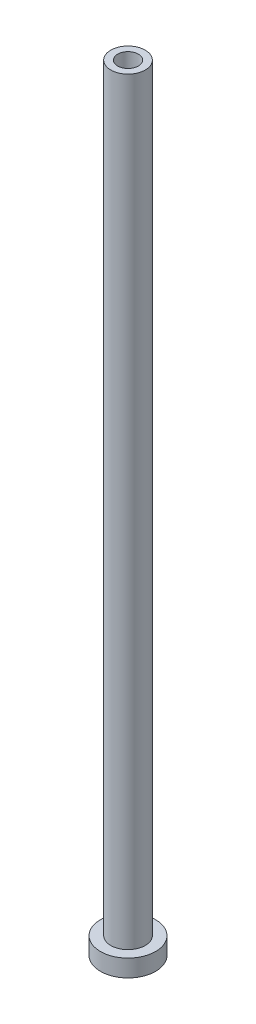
ISO-10303-21;
HEADER;
FILE_DESCRIPTION(('STEP AP214'),'2;1');
FILE_NAME('part.step','',(''),(''),'','','');
FILE_SCHEMA(('AUTOMOTIVE_DESIGN { 1 0 10303 214 1 1 1 1 }'));
ENDSEC;
DATA;
#1=APPLICATION_CONTEXT('core data for automotive mechanical design processes');
#2=APPLICATION_PROTOCOL_DEFINITION('international standard','automotive_design',2000,#1);
#3=PRODUCT_CONTEXT('',#1,'mechanical');
#4=PRODUCT('Part','Part','',(#3));
#5=PRODUCT_RELATED_PRODUCT_CATEGORY('part','',(#4));
#6=PRODUCT_DEFINITION_FORMATION('','',#4);
#7=PRODUCT_DEFINITION_CONTEXT('part definition',#1,'design');
#8=PRODUCT_DEFINITION('design','',#6,#7);
#9=PRODUCT_DEFINITION_SHAPE('','',#8);
#10=(LENGTH_UNIT() NAMED_UNIT(*) SI_UNIT(.MILLI.,.METRE.));
#11=(NAMED_UNIT(*) PLANE_ANGLE_UNIT() SI_UNIT($,.RADIAN.));
#12=(NAMED_UNIT(*) SI_UNIT($,.STERADIAN.) SOLID_ANGLE_UNIT());
#13=UNCERTAINTY_MEASURE_WITH_UNIT(LENGTH_MEASURE(1.E-05),#10,'distance_accuracy_value','');
#14=(GEOMETRIC_REPRESENTATION_CONTEXT(3) GLOBAL_UNCERTAINTY_ASSIGNED_CONTEXT((#13)) GLOBAL_UNIT_ASSIGNED_CONTEXT((#10,
#11,#12)) REPRESENTATION_CONTEXT('',''));
#15=CARTESIAN_POINT('',(0.,0.,0.));
#16=DIRECTION('',(0.,0.,1.));
#17=DIRECTION('',(1.,0.,0.));
#18=AXIS2_PLACEMENT_3D('',#15,#16,#17);
#19=CARTESIAN_POINT('',(0.,0.,0.));
#20=DIRECTION('',(0.,-1.,0.));
#21=DIRECTION('',(0.,0.,-1.));
#22=AXIS2_PLACEMENT_3D('',#19,#20,#21);
#23=CYLINDRICAL_SURFACE('',#22,8.);
#24=CARTESIAN_POINT('',(0.,-5.,0.));
#25=DIRECTION('',(0.,-1.,0.));
#26=DIRECTION('',(0.,0.,-1.));
#27=AXIS2_PLACEMENT_3D('',#24,#25,#26);
#28=CIRCLE('',#27,8.);
#29=CARTESIAN_POINT('',(0.,-5.,-8.));
#30=VERTEX_POINT('',#29);
#31=EDGE_CURVE('E42',#30,#30,#28,.T.);
#32=ORIENTED_EDGE('',*,*,#31,.F.);
#33=EDGE_LOOP('',(#32));
#34=FACE_BOUND('',#33,.T.);
#35=CARTESIAN_POINT('',(0.,0.,0.));
#36=DIRECTION('',(0.,-1.,0.));
#37=DIRECTION('',(0.,0.,-1.));
#38=AXIS2_PLACEMENT_3D('',#35,#36,#37);
#39=CIRCLE('',#38,8.);
#40=CARTESIAN_POINT('',(0.,0.,-8.));
#41=VERTEX_POINT('',#40);
#42=EDGE_CURVE('E9',#41,#41,#39,.T.);
#43=ORIENTED_EDGE('',*,*,#42,.T.);
#44=EDGE_LOOP('',(#43));
#45=FACE_BOUND('',#44,.T.);
#46=ADVANCED_FACE('F14',(#34,#45),#23,.T.);
#47=CARTESIAN_POINT('',(-8.,0.,0.));
#48=DIRECTION('',(0.,-1.,0.));
#49=DIRECTION('',(0.,0.,-1.));
#50=AXIS2_PLACEMENT_3D('',#47,#48,#49);
#51=PLANE('',#50);
#52=ORIENTED_EDGE('',*,*,#42,.F.);
#53=EDGE_LOOP('',(#52));
#54=FACE_BOUND('',#53,.T.);
#55=CARTESIAN_POINT('',(0.,0.,0.));
#56=DIRECTION('',(0.,-1.,0.));
#57=DIRECTION('',(0.,0.,-1.));
#58=AXIS2_PLACEMENT_3D('',#55,#56,#57);
#59=CIRCLE('',#58,5.);
#60=CARTESIAN_POINT('',(0.,0.,-5.));
#61=VERTEX_POINT('',#60);
#62=EDGE_CURVE('E20',#61,#61,#59,.T.);
#63=ORIENTED_EDGE('',*,*,#62,.T.);
#64=EDGE_LOOP('',(#63));
#65=FACE_BOUND('',#64,.T.);
#66=ADVANCED_FACE('F49',(#54,#65),#51,.F.);
#67=CARTESIAN_POINT('',(0.,0.,0.));
#68=DIRECTION('',(0.,-1.,0.));
#69=DIRECTION('',(0.,0.,-1.));
#70=AXIS2_PLACEMENT_3D('',#67,#68,#69);
#71=CYLINDRICAL_SURFACE('',#70,5.);
#72=ORIENTED_EDGE('',*,*,#62,.F.);
#73=EDGE_LOOP('',(#72));
#74=FACE_BOUND('',#73,.T.);
#75=CARTESIAN_POINT('',(0.,220.,0.));
#76=DIRECTION('',(0.,-1.,0.));
#77=DIRECTION('',(0.,0.,-1.));
#78=AXIS2_PLACEMENT_3D('',#75,#76,#77);
#79=CIRCLE('',#78,5.);
#80=CARTESIAN_POINT('',(0.,220.,-5.));
#81=VERTEX_POINT('',#80);
#82=EDGE_CURVE('E24',#81,#81,#79,.T.);
#83=ORIENTED_EDGE('',*,*,#82,.T.);
#84=EDGE_LOOP('',(#83));
#85=FACE_BOUND('',#84,.T.);
#86=ADVANCED_FACE('F55',(#74,#85),#71,.T.);
#87=CARTESIAN_POINT('',(-5.,220.,0.));
#88=DIRECTION('',(0.,-1.,0.));
#89=DIRECTION('',(0.,0.,-1.));
#90=AXIS2_PLACEMENT_3D('',#87,#88,#89);
#91=PLANE('',#90);
#92=ORIENTED_EDGE('',*,*,#82,.F.);
#93=EDGE_LOOP('',(#92));
#94=FACE_BOUND('',#93,.T.);
#95=CARTESIAN_POINT('',(0.,220.,0.));
#96=DIRECTION('',(0.,-1.,0.));
#97=DIRECTION('',(0.,0.,-1.));
#98=AXIS2_PLACEMENT_3D('',#95,#96,#97);
#99=CIRCLE('',#98,3.);
#100=CARTESIAN_POINT('',(0.,220.,-3.));
#101=VERTEX_POINT('',#100);
#102=EDGE_CURVE('E28',#101,#101,#99,.T.);
#103=ORIENTED_EDGE('',*,*,#102,.T.);
#104=EDGE_LOOP('',(#103));
#105=FACE_BOUND('',#104,.T.);
#106=ADVANCED_FACE('F61',(#94,#105),#91,.F.);
#107=CARTESIAN_POINT('',(0.,0.,0.));
#108=DIRECTION('',(0.,-1.,0.));
#109=DIRECTION('',(0.,0.,-1.));
#110=AXIS2_PLACEMENT_3D('',#107,#108,#109);
#111=CYLINDRICAL_SURFACE('',#110,3.);
#112=ORIENTED_EDGE('',*,*,#102,.F.);
#113=EDGE_LOOP('',(#112));
#114=FACE_BOUND('',#113,.T.);
#115=CARTESIAN_POINT('',(0.,175.,0.));
#116=DIRECTION('',(0.,-1.,0.));
#117=DIRECTION('',(0.,0.,-1.));
#118=AXIS2_PLACEMENT_3D('',#115,#116,#117);
#119=CIRCLE('',#118,3.);
#120=CARTESIAN_POINT('',(0.,175.,-3.));
#121=VERTEX_POINT('',#120);
#122=EDGE_CURVE('E33',#121,#121,#119,.T.);
#123=ORIENTED_EDGE('',*,*,#122,.T.);
#124=EDGE_LOOP('',(#123));
#125=FACE_BOUND('',#124,.T.);
#126=ADVANCED_FACE('F67',(#114,#125),#111,.F.);
#127=CARTESIAN_POINT('',(0.,174.75,0.));
#128=DIRECTION('',(0.,-1.,0.));
#129=DIRECTION('',(0.,0.,-1.));
#130=AXIS2_PLACEMENT_3D('',#127,#128,#129);
#131=CONICAL_SURFACE('',#130,3.25,0.785398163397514);
#132=ORIENTED_EDGE('',*,*,#122,.F.);
#133=EDGE_LOOP('',(#132));
#134=FACE_BOUND('',#133,.T.);
#135=CARTESIAN_POINT('',(0.,174.75,0.));
#136=DIRECTION('',(0.,-1.,0.));
#137=DIRECTION('',(0.,0.,-1.));
#138=AXIS2_PLACEMENT_3D('',#135,#136,#137);
#139=CIRCLE('',#138,3.25);
#140=CARTESIAN_POINT('',(0.,174.75,-3.25));
#141=VERTEX_POINT('',#140);
#142=EDGE_CURVE('E36',#141,#141,#139,.T.);
#143=ORIENTED_EDGE('',*,*,#142,.T.);
#144=EDGE_LOOP('',(#143));
#145=FACE_BOUND('',#144,.T.);
#146=ADVANCED_FACE('F71',(#134,#145),#131,.F.);
#147=CARTESIAN_POINT('',(0.,0.,0.));
#148=DIRECTION('',(0.,-1.,0.));
#149=DIRECTION('',(0.,0.,-1.));
#150=AXIS2_PLACEMENT_3D('',#147,#148,#149);
#151=CYLINDRICAL_SURFACE('',#150,3.25);
#152=ORIENTED_EDGE('',*,*,#142,.F.);
#153=EDGE_LOOP('',(#152));
#154=FACE_BOUND('',#153,.T.);
#155=CARTESIAN_POINT('',(0.,-5.,0.));
#156=DIRECTION('',(0.,-1.,0.));
#157=DIRECTION('',(0.,0.,-1.));
#158=AXIS2_PLACEMENT_3D('',#155,#156,#157);
#159=CIRCLE('',#158,3.25);
#160=CARTESIAN_POINT('',(0.,-5.,-3.25));
#161=VERTEX_POINT('',#160);
#162=EDGE_CURVE('E39',#161,#161,#159,.T.);
#163=ORIENTED_EDGE('',*,*,#162,.T.);
#164=EDGE_LOOP('',(#163));
#165=FACE_BOUND('',#164,.T.);
#166=ADVANCED_FACE('F75',(#154,#165),#151,.F.);
#167=CARTESIAN_POINT('',(-3.25,-5.,0.));
#168=DIRECTION('',(0.,1.,0.));
#169=DIRECTION('',(0.,0.,1.));
#170=AXIS2_PLACEMENT_3D('',#167,#168,#169);
#171=PLANE('',#170);
#172=ORIENTED_EDGE('',*,*,#162,.F.);
#173=EDGE_LOOP('',(#172));
#174=FACE_BOUND('',#173,.T.);
#175=ORIENTED_EDGE('',*,*,#31,.T.);
#176=EDGE_LOOP('',(#175));
#177=FACE_BOUND('',#176,.T.);
#178=ADVANCED_FACE('F46',(#174,#177),#171,.F.);
#179=CLOSED_SHELL('',(#46,#66,#86,#106,#126,#146,#166,#178));
#180=MANIFOLD_SOLID_BREP('B1',#179);
#181=ADVANCED_BREP_SHAPE_REPRESENTATION('',(#18,#180),#14);
#182=SHAPE_DEFINITION_REPRESENTATION(#9,#181);
ENDSEC;
END-ISO-10303-21;
